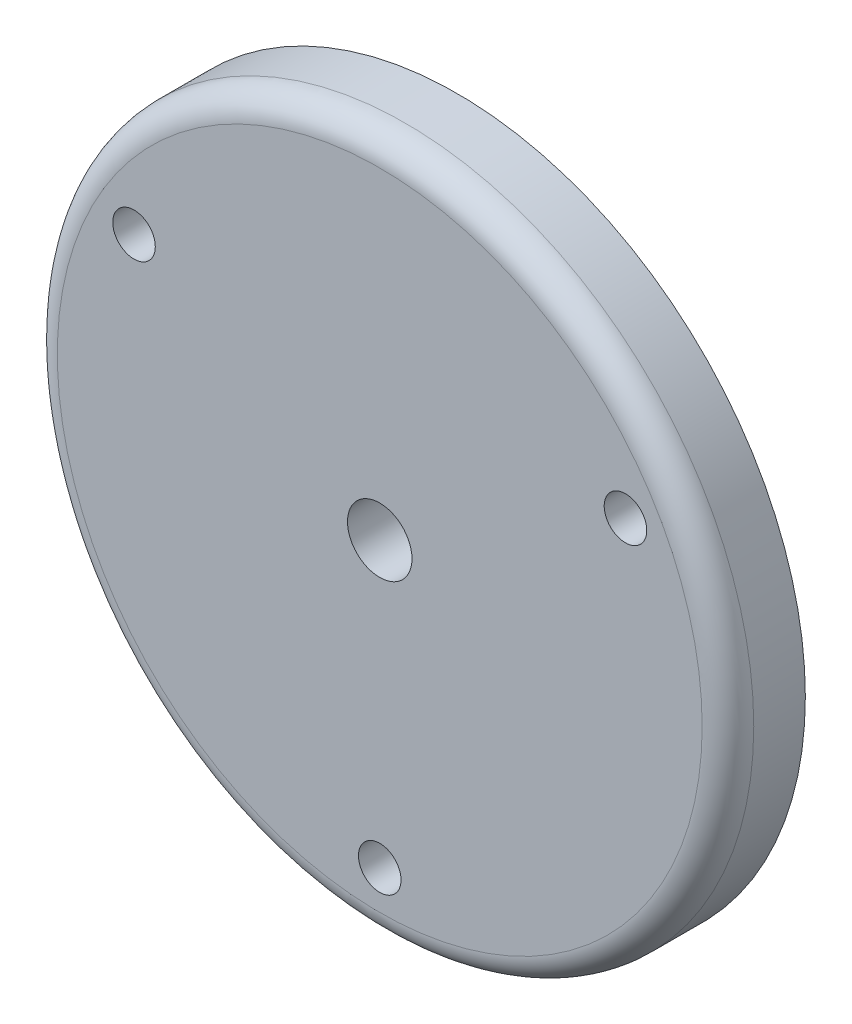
ISO-10303-21;
HEADER;
FILE_DESCRIPTION(('STEP AP214'),'2;1');
FILE_NAME('part.step','',(''),(''),'','','');
FILE_SCHEMA(('AUTOMOTIVE_DESIGN { 1 0 10303 214 1 1 1 1 }'));
ENDSEC;
DATA;
#1=APPLICATION_CONTEXT('core data for automotive mechanical design processes');
#2=APPLICATION_PROTOCOL_DEFINITION('international standard','automotive_design',2000,#1);
#3=PRODUCT_CONTEXT('',#1,'mechanical');
#4=PRODUCT('Part','Part','',(#3));
#5=PRODUCT_RELATED_PRODUCT_CATEGORY('part','',(#4));
#6=PRODUCT_DEFINITION_FORMATION('','',#4);
#7=PRODUCT_DEFINITION_CONTEXT('part definition',#1,'design');
#8=PRODUCT_DEFINITION('design','',#6,#7);
#9=PRODUCT_DEFINITION_SHAPE('','',#8);
#10=(LENGTH_UNIT() NAMED_UNIT(*) SI_UNIT(.MILLI.,.METRE.));
#11=(NAMED_UNIT(*) PLANE_ANGLE_UNIT() SI_UNIT($,.RADIAN.));
#12=(NAMED_UNIT(*) SI_UNIT($,.STERADIAN.) SOLID_ANGLE_UNIT());
#13=UNCERTAINTY_MEASURE_WITH_UNIT(LENGTH_MEASURE(1.E-05),#10,'distance_accuracy_value','');
#14=(GEOMETRIC_REPRESENTATION_CONTEXT(3) GLOBAL_UNCERTAINTY_ASSIGNED_CONTEXT((#13)) GLOBAL_UNIT_ASSIGNED_CONTEXT((#10,
#11,#12)) REPRESENTATION_CONTEXT('',''));
#15=CARTESIAN_POINT('',(0.,0.,0.));
#16=DIRECTION('',(0.,0.,1.));
#17=DIRECTION('',(1.,0.,0.));
#18=AXIS2_PLACEMENT_3D('',#15,#16,#17);
#19=CARTESIAN_POINT('',(3.,52.,2.));
#20=DIRECTION('',(0.,0.,1.));
#21=DIRECTION('',(1.,0.,0.));
#22=AXIS2_PLACEMENT_3D('',#19,#20,#21);
#23=PLANE('',#22);
#24=CARTESIAN_POINT('',(22.0525588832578,62.9999999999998,2.));
#25=DIRECTION('',(0.,0.,1.));
#26=DIRECTION('',(1.,0.,0.));
#27=AXIS2_PLACEMENT_3D('',#24,#25,#26);
#28=CIRCLE('',#27,1.64999999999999);
#29=CARTESIAN_POINT('',(23.7025588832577,62.9999999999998,2.));
#30=VERTEX_POINT('',#29);
#31=EDGE_CURVE('E71',#30,#30,#28,.F.);
#32=ORIENTED_EDGE('',*,*,#31,.F.);
#33=EDGE_LOOP('',(#32));
#34=FACE_BOUND('',#33,.T.);
#35=CARTESIAN_POINT('',(3.,52.,2.));
#36=DIRECTION('',(0.,0.,1.));
#37=DIRECTION('',(1.,0.,0.));
#38=AXIS2_PLACEMENT_3D('',#35,#36,#37);
#39=CIRCLE('',#38,17.5);
#40=CARTESIAN_POINT('',(20.5,52.,2.));
#41=VERTEX_POINT('',#40);
#42=EDGE_CURVE('E42',#41,#41,#39,.F.);
#43=ORIENTED_EDGE('',*,*,#42,.F.);
#44=EDGE_LOOP('',(#43));
#45=FACE_BOUND('',#44,.T.);
#46=CARTESIAN_POINT('',(3.,52.,2.));
#47=DIRECTION('',(0.,0.,1.));
#48=DIRECTION('',(1.,0.,0.));
#49=AXIS2_PLACEMENT_3D('',#46,#47,#48);
#50=CIRCLE('',#49,27.);
#51=CARTESIAN_POINT('',(30.,52.,2.));
#52=VERTEX_POINT('',#51);
#53=EDGE_CURVE('E46',#52,#52,#50,.T.);
#54=ORIENTED_EDGE('',*,*,#53,.F.);
#55=EDGE_LOOP('',(#54));
#56=FACE_BOUND('',#55,.T.);
#57=CARTESIAN_POINT('',(3.,30.,2.));
#58=DIRECTION('',(0.,0.,1.));
#59=DIRECTION('',(1.,0.,0.));
#60=AXIS2_PLACEMENT_3D('',#57,#58,#59);
#61=CIRCLE('',#60,1.64999999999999);
#62=CARTESIAN_POINT('',(4.64999999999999,30.,2.));
#63=VERTEX_POINT('',#62);
#64=EDGE_CURVE('E63',#63,#63,#61,.F.);
#65=ORIENTED_EDGE('',*,*,#64,.F.);
#66=EDGE_LOOP('',(#65));
#67=FACE_BOUND('',#66,.T.);
#68=CARTESIAN_POINT('',(-16.0525588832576,63.0000000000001,2.));
#69=DIRECTION('',(0.,0.,1.));
#70=DIRECTION('',(1.,0.,0.));
#71=AXIS2_PLACEMENT_3D('',#68,#69,#70);
#72=CIRCLE('',#71,1.64999999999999);
#73=CARTESIAN_POINT('',(-14.4025588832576,63.0000000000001,2.));
#74=VERTEX_POINT('',#73);
#75=EDGE_CURVE('E77',#74,#74,#72,.F.);
#76=ORIENTED_EDGE('',*,*,#75,.F.);
#77=EDGE_LOOP('',(#76));
#78=FACE_BOUND('',#77,.T.);
#79=ADVANCED_FACE('F31',(#34,#45,#56,#67,#78),#23,.F.);
#80=CARTESIAN_POINT('',(3.,52.,8.00000000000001));
#81=DIRECTION('',(0.,0.,1.));
#82=DIRECTION('',(1.,0.,0.));
#83=AXIS2_PLACEMENT_3D('',#80,#81,#82);
#84=PLANE('',#83);
#85=CARTESIAN_POINT('',(3.,52.,8.00000000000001));
#86=DIRECTION('',(0.,0.,1.));
#87=DIRECTION('',(1.,0.,0.));
#88=AXIS2_PLACEMENT_3D('',#85,#86,#87);
#89=CIRCLE('',#88,25.);
#90=CARTESIAN_POINT('',(28.,52.,8.00000000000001));
#91=VERTEX_POINT('',#90);
#92=EDGE_CURVE('E38',#91,#91,#89,.T.);
#93=ORIENTED_EDGE('',*,*,#92,.T.);
#94=EDGE_LOOP('',(#93));
#95=FACE_BOUND('',#94,.T.);
#96=CARTESIAN_POINT('',(3.,52.,8.00000000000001));
#97=DIRECTION('',(0.,0.,1.));
#98=DIRECTION('',(1.,0.,0.));
#99=AXIS2_PLACEMENT_3D('',#96,#97,#98);
#100=CIRCLE('',#99,2.5);
#101=CARTESIAN_POINT('',(5.5,52.,8.00000000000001));
#102=VERTEX_POINT('',#101);
#103=EDGE_CURVE('E52',#102,#102,#100,.T.);
#104=ORIENTED_EDGE('',*,*,#103,.F.);
#105=EDGE_LOOP('',(#104));
#106=FACE_BOUND('',#105,.T.);
#107=CARTESIAN_POINT('',(22.0525588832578,62.9999999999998,8.00000000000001));
#108=DIRECTION('',(0.,0.,1.));
#109=DIRECTION('',(1.,0.,0.));
#110=AXIS2_PLACEMENT_3D('',#107,#108,#109);
#111=CIRCLE('',#110,1.64999999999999);
#112=CARTESIAN_POINT('',(23.7025588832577,62.9999999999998,8.00000000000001));
#113=VERTEX_POINT('',#112);
#114=EDGE_CURVE('E74',#113,#113,#111,.T.);
#115=ORIENTED_EDGE('',*,*,#114,.F.);
#116=EDGE_LOOP('',(#115));
#117=FACE_BOUND('',#116,.T.);
#118=CARTESIAN_POINT('',(3.,30.,8.00000000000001));
#119=DIRECTION('',(0.,0.,1.));
#120=DIRECTION('',(1.,0.,0.));
#121=AXIS2_PLACEMENT_3D('',#118,#119,#120);
#122=CIRCLE('',#121,1.64999999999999);
#123=CARTESIAN_POINT('',(4.64999999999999,30.,8.00000000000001));
#124=VERTEX_POINT('',#123);
#125=EDGE_CURVE('E68',#124,#124,#122,.T.);
#126=ORIENTED_EDGE('',*,*,#125,.F.);
#127=EDGE_LOOP('',(#126));
#128=FACE_BOUND('',#127,.T.);
#129=CARTESIAN_POINT('',(-16.0525588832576,63.0000000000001,8.00000000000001));
#130=DIRECTION('',(0.,0.,1.));
#131=DIRECTION('',(1.,0.,0.));
#132=AXIS2_PLACEMENT_3D('',#129,#130,#131);
#133=CIRCLE('',#132,1.64999999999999);
#134=CARTESIAN_POINT('',(-14.4025588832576,63.0000000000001,8.00000000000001));
#135=VERTEX_POINT('',#134);
#136=EDGE_CURVE('E51',#135,#135,#133,.T.);
#137=ORIENTED_EDGE('',*,*,#136,.F.);
#138=EDGE_LOOP('',(#137));
#139=FACE_BOUND('',#138,.T.);
#140=ADVANCED_FACE('F88',(#95,#106,#117,#128,#139),#84,.T.);
#141=CARTESIAN_POINT('',(3.,52.,8.00000000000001));
#142=DIRECTION('',(0.,0.,-1.));
#143=DIRECTION('',(-1.,0.,0.));
#144=AXIS2_PLACEMENT_3D('',#141,#142,#143);
#145=CYLINDRICAL_SURFACE('',#144,27.);
#146=CARTESIAN_POINT('',(3.,52.,6.00000000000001));
#147=DIRECTION('',(0.,0.,1.));
#148=DIRECTION('',(1.,0.,0.));
#149=AXIS2_PLACEMENT_3D('',#146,#147,#148);
#150=CIRCLE('',#149,27.);
#151=CARTESIAN_POINT('',(30.,52.,6.00000000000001));
#152=VERTEX_POINT('',#151);
#153=EDGE_CURVE('E10',#152,#152,#150,.F.);
#154=ORIENTED_EDGE('',*,*,#153,.T.);
#155=EDGE_LOOP('',(#154));
#156=FACE_BOUND('',#155,.T.);
#157=ORIENTED_EDGE('',*,*,#53,.T.);
#158=EDGE_LOOP('',(#157));
#159=FACE_BOUND('',#158,.T.);
#160=ADVANCED_FACE('F91',(#156,#159),#145,.T.);
#161=CARTESIAN_POINT('',(3.,52.,-2.));
#162=DIRECTION('',(0.,0.,-1.));
#163=DIRECTION('',(-1.,0.,0.));
#164=AXIS2_PLACEMENT_3D('',#161,#162,#163);
#165=PLANE('',#164);
#166=CARTESIAN_POINT('',(3.,52.,-2.));
#167=DIRECTION('',(0.,0.,-1.));
#168=DIRECTION('',(-1.,0.,0.));
#169=AXIS2_PLACEMENT_3D('',#166,#167,#168);
#170=CIRCLE('',#169,17.5);
#171=CARTESIAN_POINT('',(-14.5,52.,-2.));
#172=VERTEX_POINT('',#171);
#173=EDGE_CURVE('E56',#172,#172,#170,.T.);
#174=ORIENTED_EDGE('',*,*,#173,.T.);
#175=EDGE_LOOP('',(#174));
#176=FACE_BOUND('',#175,.T.);
#177=CARTESIAN_POINT('',(3.,52.,-2.));
#178=DIRECTION('',(0.,0.,-1.));
#179=DIRECTION('',(-1.,0.,0.));
#180=AXIS2_PLACEMENT_3D('',#177,#178,#179);
#181=CIRCLE('',#180,14.);
#182=CARTESIAN_POINT('',(-11.,52.,-2.));
#183=VERTEX_POINT('',#182);
#184=EDGE_CURVE('E59',#183,#183,#181,.T.);
#185=ORIENTED_EDGE('',*,*,#184,.F.);
#186=EDGE_LOOP('',(#185));
#187=FACE_BOUND('',#186,.T.);
#188=ADVANCED_FACE('F141',(#176,#187),#165,.T.);
#189=CARTESIAN_POINT('',(3.,52.,-2.));
#190=DIRECTION('',(0.,0.,1.));
#191=DIRECTION('',(1.,0.,0.));
#192=AXIS2_PLACEMENT_3D('',#189,#190,#191);
#193=CYLINDRICAL_SURFACE('',#192,17.5);
#194=ORIENTED_EDGE('',*,*,#173,.F.);
#195=EDGE_LOOP('',(#194));
#196=FACE_BOUND('',#195,.T.);
#197=ORIENTED_EDGE('',*,*,#42,.T.);
#198=EDGE_LOOP('',(#197));
#199=FACE_BOUND('',#198,.T.);
#200=ADVANCED_FACE('F124',(#196,#199),#193,.T.);
#201=CARTESIAN_POINT('',(3.,52.,-2.));
#202=DIRECTION('',(0.,0.,1.));
#203=DIRECTION('',(1.,0.,0.));
#204=AXIS2_PLACEMENT_3D('',#201,#202,#203);
#205=CYLINDRICAL_SURFACE('',#204,14.);
#206=ORIENTED_EDGE('',*,*,#184,.T.);
#207=EDGE_LOOP('',(#206));
#208=FACE_BOUND('',#207,.T.);
#209=CARTESIAN_POINT('',(3.,52.,2.));
#210=DIRECTION('',(0.,0.,-1.));
#211=DIRECTION('',(-1.,0.,0.));
#212=AXIS2_PLACEMENT_3D('',#209,#210,#211);
#213=CIRCLE('',#212,14.);
#214=CARTESIAN_POINT('',(-11.,52.,2.));
#215=VERTEX_POINT('',#214);
#216=EDGE_CURVE('E60',#215,#215,#213,.T.);
#217=ORIENTED_EDGE('',*,*,#216,.F.);
#218=EDGE_LOOP('',(#217));
#219=FACE_BOUND('',#218,.T.);
#220=ADVANCED_FACE('F116',(#208,#219),#205,.F.);
#221=CARTESIAN_POINT('',(3.,52.,2.));
#222=DIRECTION('',(0.,0.,1.));
#223=DIRECTION('',(1.,0.,0.));
#224=AXIS2_PLACEMENT_3D('',#221,#222,#223);
#225=CIRCLE('',#224,2.5);
#226=CARTESIAN_POINT('',(5.5,52.,2.));
#227=VERTEX_POINT('',#226);
#228=EDGE_CURVE('E49',#227,#227,#225,.T.);
#229=ORIENTED_EDGE('',*,*,#228,.T.);
#230=EDGE_LOOP('',(#229));
#231=FACE_BOUND('',#230,.T.);
#232=ORIENTED_EDGE('',*,*,#216,.T.);
#233=EDGE_LOOP('',(#232));
#234=FACE_BOUND('',#233,.T.);
#235=ADVANCED_FACE('F109',(#231,#234),#23,.F.);
#236=CARTESIAN_POINT('',(3.,30.,8.00000000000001));
#237=DIRECTION('',(0.,0.,-1.));
#238=DIRECTION('',(-1.,0.,0.));
#239=AXIS2_PLACEMENT_3D('',#236,#237,#238);
#240=CYLINDRICAL_SURFACE('',#239,1.64999999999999);
#241=ORIENTED_EDGE('',*,*,#125,.T.);
#242=EDGE_LOOP('',(#241));
#243=FACE_BOUND('',#242,.T.);
#244=ORIENTED_EDGE('',*,*,#64,.T.);
#245=EDGE_LOOP('',(#244));
#246=FACE_BOUND('',#245,.T.);
#247=ADVANCED_FACE('F115',(#243,#246),#240,.F.);
#248=CARTESIAN_POINT('',(22.0525588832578,62.9999999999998,8.00000000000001));
#249=DIRECTION('',(0.,0.,-1.));
#250=DIRECTION('',(-1.,0.,0.));
#251=AXIS2_PLACEMENT_3D('',#248,#249,#250);
#252=CYLINDRICAL_SURFACE('',#251,1.64999999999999);
#253=ORIENTED_EDGE('',*,*,#114,.T.);
#254=EDGE_LOOP('',(#253));
#255=FACE_BOUND('',#254,.T.);
#256=ORIENTED_EDGE('',*,*,#31,.T.);
#257=EDGE_LOOP('',(#256));
#258=FACE_BOUND('',#257,.T.);
#259=ADVANCED_FACE('F102',(#255,#258),#252,.F.);
#260=CARTESIAN_POINT('',(-16.0525588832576,63.0000000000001,8.00000000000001));
#261=DIRECTION('',(0.,0.,-1.));
#262=DIRECTION('',(-1.,0.,0.));
#263=AXIS2_PLACEMENT_3D('',#260,#261,#262);
#264=CYLINDRICAL_SURFACE('',#263,1.64999999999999);
#265=ORIENTED_EDGE('',*,*,#136,.T.);
#266=EDGE_LOOP('',(#265));
#267=FACE_BOUND('',#266,.T.);
#268=ORIENTED_EDGE('',*,*,#75,.T.);
#269=EDGE_LOOP('',(#268));
#270=FACE_BOUND('',#269,.T.);
#271=ADVANCED_FACE('F99',(#267,#270),#264,.F.);
#272=CARTESIAN_POINT('',(3.,52.,8.00000000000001));
#273=DIRECTION('',(0.,0.,1.));
#274=DIRECTION('',(1.,0.,0.));
#275=AXIS2_PLACEMENT_3D('',#272,#273,#274);
#276=CYLINDRICAL_SURFACE('',#275,2.5);
#277=ORIENTED_EDGE('',*,*,#103,.T.);
#278=EDGE_LOOP('',(#277));
#279=FACE_BOUND('',#278,.T.);
#280=ORIENTED_EDGE('',*,*,#228,.F.);
#281=EDGE_LOOP('',(#280));
#282=FACE_BOUND('',#281,.T.);
#283=ADVANCED_FACE('F85',(#279,#282),#276,.F.);
#284=CARTESIAN_POINT('',(3.,52.,6.00000000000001));
#285=DIRECTION('',(0.,0.,1.));
#286=DIRECTION('',(1.,0.,0.));
#287=AXIS2_PLACEMENT_3D('',#284,#285,#286);
#288=TOROIDAL_SURFACE('',#287,25.,2.);
#289=ORIENTED_EDGE('',*,*,#153,.F.);
#290=EDGE_LOOP('',(#289));
#291=FACE_BOUND('',#290,.T.);
#292=ORIENTED_EDGE('',*,*,#92,.F.);
#293=EDGE_LOOP('',(#292));
#294=FACE_BOUND('',#293,.T.);
#295=ADVANCED_FACE('F33',(#291,#294),#288,.T.);
#296=CLOSED_SHELL('',(#79,#140,#160,#188,#200,#220,#235,#247,#259,#271,#283,#295));
#297=MANIFOLD_SOLID_BREP('B2',#296);
#298=ADVANCED_BREP_SHAPE_REPRESENTATION('',(#18,#297),#14);
#299=SHAPE_DEFINITION_REPRESENTATION(#9,#298);
ENDSEC;
END-ISO-10303-21;
